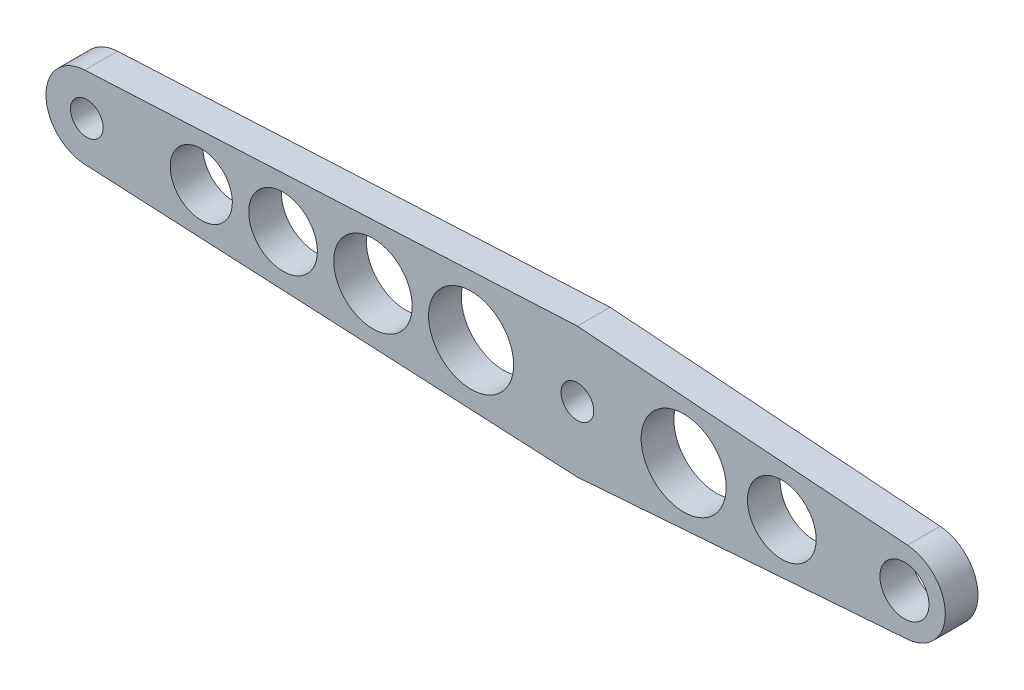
from build123d import *

# Parameters (mm, degrees)
SKETCH1_R           = 1
SKETCH1_R_2         = 1.9
SKETCH1_R_3         = 2.1
SKETCH1_R_4         = 2.4
SKETCH1_R_5         = 2.6
SKETCH1_R_6         = 1.5
BOSS_EXTRUDE1_DEPTH = 2


with BuildPart() as part:
    # Sketch1 → Boss-Extrude1 (new body)
    with BuildSketch(Plane.XY):
        with BuildLine():
            Line((-30.124585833, 2.496893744), (0, 4))
            Line((0, 4), (20.18611256, 2.493062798))
            ThreePointArc((20.18611256, 2.493062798), (22.5, 0), (20.18611256, -2.493062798))
            Line((20.18611256, -2.493062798), (0, -4))
            Line((0, -4), (-30.124585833, -2.496893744))
            ThreePointArc((-30.124585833, -2.496893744), (-32.5, 0), (-30.124585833, 2.496893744))
        make_face()
        Circle(SKETCH1_R, mode=Mode.SUBTRACT)
        with Locations((-30, 0)):
            Circle(SKETCH1_R, mode=Mode.SUBTRACT)
        with Locations((-23, 0)):
            Circle(SKETCH1_R_2, mode=Mode.SUBTRACT)
        with Locations((-18, 0)):
            Circle(SKETCH1_R_3, mode=Mode.SUBTRACT)
        with Locations((-12.5, 0)):
            Circle(SKETCH1_R_4, mode=Mode.SUBTRACT)
        with Locations((-6.5, 0)):
            Circle(SKETCH1_R_5, mode=Mode.SUBTRACT)
        with Locations((6.5, 0)):
            Circle(SKETCH1_R_5, mode=Mode.SUBTRACT)
        with Locations((12.5, 0)):
            Circle(SKETCH1_R_3, mode=Mode.SUBTRACT)
        with Locations((20, 0)):
            Circle(SKETCH1_R_6, mode=Mode.SUBTRACT)
    extrude(amount=BOSS_EXTRUDE1_DEPTH)


solid = part.part
